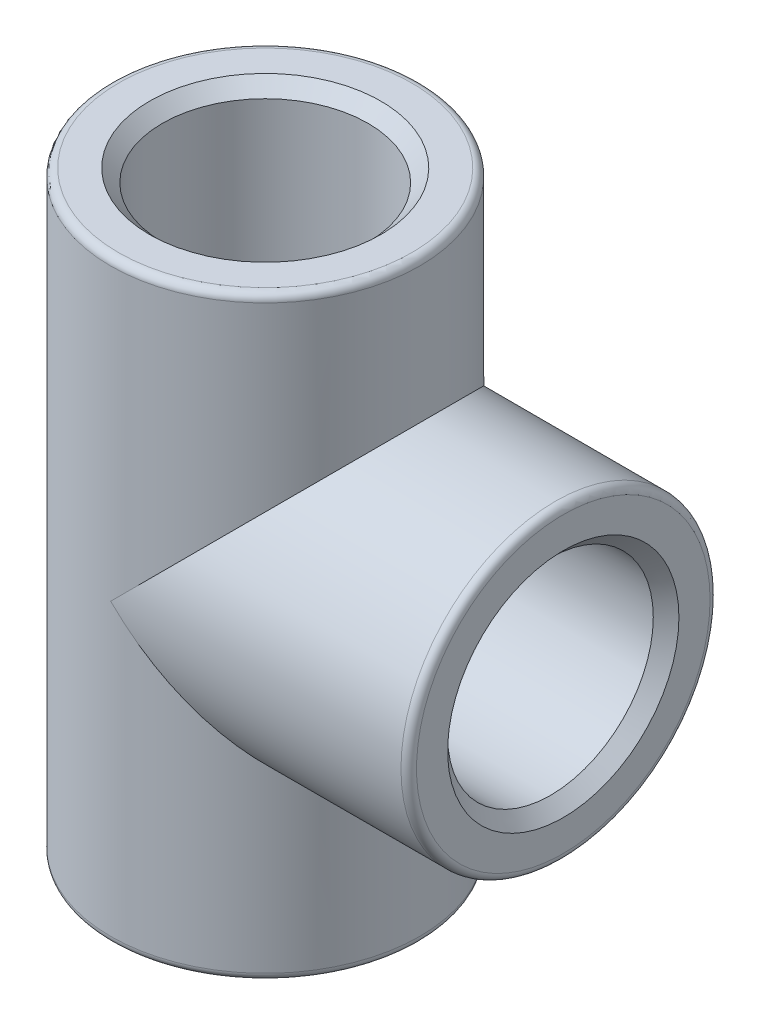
ISO-10303-21;
HEADER;
FILE_DESCRIPTION(('STEP AP214'),'2;1');
FILE_NAME('part.step','',(''),(''),'','','');
FILE_SCHEMA(('AUTOMOTIVE_DESIGN { 1 0 10303 214 1 1 1 1 }'));
ENDSEC;
DATA;
#1=APPLICATION_CONTEXT('core data for automotive mechanical design processes');
#2=APPLICATION_PROTOCOL_DEFINITION('international standard','automotive_design',2000,#1);
#3=PRODUCT_CONTEXT('',#1,'mechanical');
#4=PRODUCT('Part','Part','',(#3));
#5=PRODUCT_RELATED_PRODUCT_CATEGORY('part','',(#4));
#6=PRODUCT_DEFINITION_FORMATION('','',#4);
#7=PRODUCT_DEFINITION_CONTEXT('part definition',#1,'design');
#8=PRODUCT_DEFINITION('design','',#6,#7);
#9=PRODUCT_DEFINITION_SHAPE('','',#8);
#10=(LENGTH_UNIT() NAMED_UNIT(*) SI_UNIT(.MILLI.,.METRE.));
#11=(NAMED_UNIT(*) PLANE_ANGLE_UNIT() SI_UNIT($,.RADIAN.));
#12=(NAMED_UNIT(*) SI_UNIT($,.STERADIAN.) SOLID_ANGLE_UNIT());
#13=UNCERTAINTY_MEASURE_WITH_UNIT(LENGTH_MEASURE(1.E-05),#10,'distance_accuracy_value','');
#14=(GEOMETRIC_REPRESENTATION_CONTEXT(3) GLOBAL_UNCERTAINTY_ASSIGNED_CONTEXT((#13)) GLOBAL_UNIT_ASSIGNED_CONTEXT((#10,
#11,#12)) REPRESENTATION_CONTEXT('',''));
#15=CARTESIAN_POINT('',(0.,0.,0.));
#16=DIRECTION('',(0.,0.,1.));
#17=DIRECTION('',(1.,0.,0.));
#18=AXIS2_PLACEMENT_3D('',#15,#16,#17);
#19=CARTESIAN_POINT('',(0.,0.,0.));
#20=DIRECTION('',(0.,1.,0.));
#21=DIRECTION('',(0.,0.,1.));
#22=AXIS2_PLACEMENT_3D('',#19,#20,#21);
#23=CYLINDRICAL_SURFACE('',#22,14.);
#24=CARTESIAN_POINT('',(0.,0.7045,0.));
#25=DIRECTION('',(0.,-1.,0.));
#26=DIRECTION('',(0.,0.,-1.));
#27=AXIS2_PLACEMENT_3D('',#24,#25,#26);
#28=CIRCLE('',#27,14.);
#29=CARTESIAN_POINT('',(0.,0.7045,-14.));
#30=VERTEX_POINT('',#29);
#31=EDGE_CURVE('E92',#30,#30,#28,.F.);
#32=ORIENTED_EDGE('',*,*,#31,.T.);
#33=EDGE_LOOP('',(#32));
#34=FACE_BOUND('',#33,.T.);
#35=CARTESIAN_POINT('',(0.,53.2955,0.));
#36=DIRECTION('',(0.,1.,0.));
#37=DIRECTION('',(0.,0.,1.));
#38=AXIS2_PLACEMENT_3D('',#35,#36,#37);
#39=CIRCLE('',#38,14.);
#40=CARTESIAN_POINT('',(0.,53.2955,14.));
#41=VERTEX_POINT('',#40);
#42=EDGE_CURVE('E89',#41,#41,#39,.F.);
#43=ORIENTED_EDGE('',*,*,#42,.T.);
#44=EDGE_LOOP('',(#43));
#45=FACE_BOUND('',#44,.T.);
#46=CARTESIAN_POINT('',(0.,27.,0.));
#47=DIRECTION('',(0.707106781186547,0.707106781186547,0.));
#48=DIRECTION('',(-0.707106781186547,0.707106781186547,0.));
#49=AXIS2_PLACEMENT_3D('',#46,#47,#48);
#50=ELLIPSE('',#49,19.7989898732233,14.);
#51=CARTESIAN_POINT('',(0.,27.,14.));
#52=VERTEX_POINT('',#51);
#53=CARTESIAN_POINT('',(0.,27.,-14.));
#54=VERTEX_POINT('',#53);
#55=EDGE_CURVE('E64',#52,#54,#50,.T.);
#56=ORIENTED_EDGE('',*,*,#55,.F.);
#57=CARTESIAN_POINT('',(0.,27.,0.));
#58=DIRECTION('',(-0.707106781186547,0.707106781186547,0.));
#59=DIRECTION('',(0.707106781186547,0.707106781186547,0.));
#60=AXIS2_PLACEMENT_3D('',#57,#58,#59);
#61=ELLIPSE('',#60,19.7989898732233,14.);
#62=EDGE_CURVE('E55',#54,#52,#61,.F.);
#63=ORIENTED_EDGE('',*,*,#62,.F.);
#64=EDGE_LOOP('',(#56,#63));
#65=FACE_BOUND('',#64,.T.);
#66=ADVANCED_FACE('F34',(#34,#45,#65),#23,.T.);
#67=CARTESIAN_POINT('',(14.,0.,0.));
#68=DIRECTION('',(0.,-1.,0.));
#69=DIRECTION('',(0.,0.,-1.));
#70=AXIS2_PLACEMENT_3D('',#67,#68,#69);
#71=PLANE('',#70);
#72=CARTESIAN_POINT('',(0.,0.,0.));
#73=DIRECTION('',(0.,-1.,0.));
#74=DIRECTION('',(0.,0.,-1.));
#75=AXIS2_PLACEMENT_3D('',#72,#73,#74);
#76=CIRCLE('',#75,13.2955);
#77=CARTESIAN_POINT('',(0.,0.,-13.2955));
#78=VERTEX_POINT('',#77);
#79=EDGE_CURVE('E95',#78,#78,#76,.T.);
#80=ORIENTED_EDGE('',*,*,#79,.T.);
#81=EDGE_LOOP('',(#80));
#82=FACE_BOUND('',#81,.T.);
#83=CARTESIAN_POINT('',(0.,0.,0.));
#84=DIRECTION('',(0.,-1.,0.));
#85=DIRECTION('',(0.,0.,-1.));
#86=AXIS2_PLACEMENT_3D('',#83,#84,#85);
#87=CIRCLE('',#86,10.4775);
#88=CARTESIAN_POINT('',(0.,0.,-10.4775));
#89=VERTEX_POINT('',#88);
#90=EDGE_CURVE('E77',#89,#89,#87,.F.);
#91=ORIENTED_EDGE('',*,*,#90,.T.);
#92=EDGE_LOOP('',(#91));
#93=FACE_BOUND('',#92,.T.);
#94=ADVANCED_FACE('F116',(#82,#93),#71,.T.);
#95=CARTESIAN_POINT('',(0.,54.,0.));
#96=DIRECTION('',(0.,1.,0.));
#97=DIRECTION('',(0.,0.,1.));
#98=AXIS2_PLACEMENT_3D('',#95,#96,#97);
#99=PLANE('',#98);
#100=CARTESIAN_POINT('',(0.,54.,0.));
#101=DIRECTION('',(0.,1.,0.));
#102=DIRECTION('',(0.,0.,1.));
#103=AXIS2_PLACEMENT_3D('',#100,#101,#102);
#104=CIRCLE('',#103,13.2955);
#105=CARTESIAN_POINT('',(0.,54.,13.2955));
#106=VERTEX_POINT('',#105);
#107=EDGE_CURVE('E98',#106,#106,#104,.T.);
#108=ORIENTED_EDGE('',*,*,#107,.T.);
#109=EDGE_LOOP('',(#108));
#110=FACE_BOUND('',#109,.T.);
#111=CARTESIAN_POINT('',(0.,54.,0.));
#112=DIRECTION('',(0.,1.,0.));
#113=DIRECTION('',(0.,0.,1.));
#114=AXIS2_PLACEMENT_3D('',#111,#112,#113);
#115=CIRCLE('',#114,10.4775);
#116=CARTESIAN_POINT('',(0.,54.,10.4775));
#117=VERTEX_POINT('',#116);
#118=EDGE_CURVE('E71',#117,#117,#115,.F.);
#119=ORIENTED_EDGE('',*,*,#118,.T.);
#120=EDGE_LOOP('',(#119));
#121=FACE_BOUND('',#120,.T.);
#122=ADVANCED_FACE('F122',(#110,#121),#99,.T.);
#123=CARTESIAN_POINT('',(27.,27.,0.));
#124=DIRECTION('',(1.,0.,0.));
#125=DIRECTION('',(0.,0.,-1.));
#126=AXIS2_PLACEMENT_3D('',#123,#124,#125);
#127=PLANE('',#126);
#128=CARTESIAN_POINT('',(27.,27.,0.));
#129=DIRECTION('',(1.,0.,0.));
#130=DIRECTION('',(0.,0.,-1.));
#131=AXIS2_PLACEMENT_3D('',#128,#129,#130);
#132=CIRCLE('',#131,13.2955);
#133=CARTESIAN_POINT('',(27.,27.,-13.2955));
#134=VERTEX_POINT('',#133);
#135=EDGE_CURVE('E42',#134,#134,#132,.T.);
#136=ORIENTED_EDGE('',*,*,#135,.T.);
#137=EDGE_LOOP('',(#136));
#138=FACE_BOUND('',#137,.T.);
#139=CARTESIAN_POINT('',(27.,27.,0.));
#140=DIRECTION('',(1.,0.,0.));
#141=DIRECTION('',(0.,0.,-1.));
#142=AXIS2_PLACEMENT_3D('',#139,#140,#141);
#143=CIRCLE('',#142,10.4775);
#144=CARTESIAN_POINT('',(27.,27.,-10.4775));
#145=VERTEX_POINT('',#144);
#146=EDGE_CURVE('E86',#145,#145,#143,.F.);
#147=ORIENTED_EDGE('',*,*,#146,.T.);
#148=EDGE_LOOP('',(#147));
#149=FACE_BOUND('',#148,.T.);
#150=ADVANCED_FACE('F103',(#138,#149),#127,.T.);
#151=CARTESIAN_POINT('',(0.,27.,0.));
#152=DIRECTION('',(1.,0.,0.));
#153=DIRECTION('',(0.,0.,-1.));
#154=AXIS2_PLACEMENT_3D('',#151,#152,#153);
#155=CYLINDRICAL_SURFACE('',#154,14.);
#156=CARTESIAN_POINT('',(26.2955,27.,0.));
#157=DIRECTION('',(1.,0.,0.));
#158=DIRECTION('',(0.,0.,-1.));
#159=AXIS2_PLACEMENT_3D('',#156,#157,#158);
#160=CIRCLE('',#159,14.);
#161=CARTESIAN_POINT('',(26.2955,27.,-14.));
#162=VERTEX_POINT('',#161);
#163=EDGE_CURVE('E11',#162,#162,#160,.F.);
#164=ORIENTED_EDGE('',*,*,#163,.T.);
#165=EDGE_LOOP('',(#164));
#166=FACE_BOUND('',#165,.T.);
#167=ORIENTED_EDGE('',*,*,#62,.T.);
#168=ORIENTED_EDGE('',*,*,#55,.T.);
#169=EDGE_LOOP('',(#167,#168));
#170=FACE_BOUND('',#169,.T.);
#171=ADVANCED_FACE('F247',(#166,#170),#155,.T.);
#172=CARTESIAN_POINT('',(0.,0.,0.));
#173=DIRECTION('',(0.,1.,0.));
#174=DIRECTION('',(0.,0.,1.));
#175=AXIS2_PLACEMENT_3D('',#172,#173,#174);
#176=CYLINDRICAL_SURFACE('',#175,9.3155);
#177=CARTESIAN_POINT('',(0.,1.162,0.));
#178=DIRECTION('',(0.,-1.,0.));
#179=DIRECTION('',(0.,0.,-1.));
#180=AXIS2_PLACEMENT_3D('',#177,#178,#179);
#181=CIRCLE('',#180,9.3155);
#182=CARTESIAN_POINT('',(0.,1.162,-9.3155));
#183=VERTEX_POINT('',#182);
#184=EDGE_CURVE('E80',#183,#183,#181,.T.);
#185=ORIENTED_EDGE('',*,*,#184,.T.);
#186=EDGE_LOOP('',(#185));
#187=FACE_BOUND('',#186,.T.);
#188=CARTESIAN_POINT('',(0.,16.,0.));
#189=DIRECTION('',(0.,1.,0.));
#190=DIRECTION('',(0.,0.,1.));
#191=AXIS2_PLACEMENT_3D('',#188,#189,#190);
#192=CIRCLE('',#191,9.3155);
#193=CARTESIAN_POINT('',(0.,16.,9.3155));
#194=VERTEX_POINT('',#193);
#195=EDGE_CURVE('E314',#194,#194,#192,.T.);
#196=ORIENTED_EDGE('',*,*,#195,.T.);
#197=EDGE_LOOP('',(#196));
#198=FACE_BOUND('',#197,.T.);
#199=ADVANCED_FACE('F239',(#187,#198),#176,.F.);
#200=CARTESIAN_POINT('',(0.,0.,0.));
#201=DIRECTION('',(0.,1.,0.));
#202=DIRECTION('',(0.,0.,1.));
#203=AXIS2_PLACEMENT_3D('',#200,#201,#202);
#204=CYLINDRICAL_SURFACE('',#203,9.3155);
#205=CARTESIAN_POINT('',(0.,52.838,0.));
#206=DIRECTION('',(0.,1.,0.));
#207=DIRECTION('',(0.,0.,1.));
#208=AXIS2_PLACEMENT_3D('',#205,#206,#207);
#209=CIRCLE('',#208,9.3155);
#210=CARTESIAN_POINT('',(0.,52.838,9.3155));
#211=VERTEX_POINT('',#210);
#212=EDGE_CURVE('E68',#211,#211,#209,.T.);
#213=ORIENTED_EDGE('',*,*,#212,.T.);
#214=EDGE_LOOP('',(#213));
#215=FACE_BOUND('',#214,.T.);
#216=CARTESIAN_POINT('',(0.,38.,0.));
#217=DIRECTION('',(0.,1.,0.));
#218=DIRECTION('',(0.,0.,1.));
#219=AXIS2_PLACEMENT_3D('',#216,#217,#218);
#220=CIRCLE('',#219,9.3155);
#221=CARTESIAN_POINT('',(0.,38.,9.3155));
#222=VERTEX_POINT('',#221);
#223=EDGE_CURVE('E302',#222,#222,#220,.T.);
#224=ORIENTED_EDGE('',*,*,#223,.F.);
#225=EDGE_LOOP('',(#224));
#226=FACE_BOUND('',#225,.T.);
#227=ADVANCED_FACE('F231',(#215,#226),#204,.F.);
#228=CARTESIAN_POINT('',(9.3155,38.,0.));
#229=DIRECTION('',(0.,-1.,0.));
#230=DIRECTION('',(0.,0.,-1.));
#231=AXIS2_PLACEMENT_3D('',#228,#229,#230);
#232=PLANE('',#231);
#233=CARTESIAN_POINT('',(0.,38.,0.));
#234=DIRECTION('',(0.,1.,0.));
#235=DIRECTION('',(0.,0.,1.));
#236=AXIS2_PLACEMENT_3D('',#233,#234,#235);
#237=CIRCLE('',#236,8.38395);
#238=CARTESIAN_POINT('',(0.,38.,8.38395));
#239=VERTEX_POINT('',#238);
#240=EDGE_CURVE('E304',#239,#239,#237,.T.);
#241=ORIENTED_EDGE('',*,*,#240,.F.);
#242=EDGE_LOOP('',(#241));
#243=FACE_BOUND('',#242,.T.);
#244=ORIENTED_EDGE('',*,*,#223,.T.);
#245=EDGE_LOOP('',(#244));
#246=FACE_BOUND('',#245,.T.);
#247=ADVANCED_FACE('F224',(#243,#246),#232,.F.);
#248=CARTESIAN_POINT('',(0.,0.,0.));
#249=DIRECTION('',(0.,1.,0.));
#250=DIRECTION('',(0.,0.,1.));
#251=AXIS2_PLACEMENT_3D('',#248,#249,#250);
#252=CYLINDRICAL_SURFACE('',#251,8.38395);
#253=CARTESIAN_POINT('',(0.,27.,0.));
#254=DIRECTION('',(-0.707106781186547,0.707106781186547,0.));
#255=DIRECTION('',(0.707106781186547,0.707106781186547,0.));
#256=AXIS2_PLACEMENT_3D('',#253,#254,#255);
#257=ELLIPSE('',#256,11.8566957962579,8.38395);
#258=CARTESIAN_POINT('',(0.,27.,-8.38394999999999));
#259=VERTEX_POINT('',#258);
#260=CARTESIAN_POINT('',(0.,27.,8.38395));
#261=VERTEX_POINT('',#260);
#262=EDGE_CURVE('E60',#259,#261,#257,.F.);
#263=ORIENTED_EDGE('',*,*,#262,.T.);
#264=CARTESIAN_POINT('',(0.,27.,0.));
#265=DIRECTION('',(0.707106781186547,0.707106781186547,0.));
#266=DIRECTION('',(-0.707106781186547,0.707106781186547,0.));
#267=AXIS2_PLACEMENT_3D('',#264,#265,#266);
#268=ELLIPSE('',#267,11.8566957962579,8.38395);
#269=EDGE_CURVE('E48',#261,#259,#268,.T.);
#270=ORIENTED_EDGE('',*,*,#269,.T.);
#271=EDGE_LOOP('',(#263,#270));
#272=FACE_BOUND('',#271,.T.);
#273=CARTESIAN_POINT('',(0.,16.,0.));
#274=DIRECTION('',(0.,1.,0.));
#275=DIRECTION('',(0.,0.,1.));
#276=AXIS2_PLACEMENT_3D('',#273,#274,#275);
#277=CIRCLE('',#276,8.38395);
#278=CARTESIAN_POINT('',(0.,16.,8.38395));
#279=VERTEX_POINT('',#278);
#280=EDGE_CURVE('E308',#279,#279,#277,.T.);
#281=ORIENTED_EDGE('',*,*,#280,.F.);
#282=EDGE_LOOP('',(#281));
#283=FACE_BOUND('',#282,.T.);
#284=ORIENTED_EDGE('',*,*,#240,.T.);
#285=EDGE_LOOP('',(#284));
#286=FACE_BOUND('',#285,.T.);
#287=ADVANCED_FACE('F66',(#272,#283,#286),#252,.F.);
#288=CARTESIAN_POINT('',(8.38395,16.,0.));
#289=DIRECTION('',(0.,1.,0.));
#290=DIRECTION('',(0.,0.,1.));
#291=AXIS2_PLACEMENT_3D('',#288,#289,#290);
#292=PLANE('',#291);
#293=ORIENTED_EDGE('',*,*,#195,.F.);
#294=EDGE_LOOP('',(#293));
#295=FACE_BOUND('',#294,.T.);
#296=ORIENTED_EDGE('',*,*,#280,.T.);
#297=EDGE_LOOP('',(#296));
#298=FACE_BOUND('',#297,.T.);
#299=ADVANCED_FACE('F207',(#295,#298),#292,.F.);
#300=CARTESIAN_POINT('',(27.,27.,0.));
#301=DIRECTION('',(1.,0.,0.));
#302=DIRECTION('',(0.,0.,-1.));
#303=AXIS2_PLACEMENT_3D('',#300,#301,#302);
#304=CYLINDRICAL_SURFACE('',#303,8.38395);
#305=ORIENTED_EDGE('',*,*,#262,.F.);
#306=ORIENTED_EDGE('',*,*,#269,.F.);
#307=EDGE_LOOP('',(#305,#306));
#308=FACE_BOUND('',#307,.T.);
#309=CARTESIAN_POINT('',(11.,27.,0.));
#310=DIRECTION('',(1.,0.,0.));
#311=DIRECTION('',(0.,0.,-1.));
#312=AXIS2_PLACEMENT_3D('',#309,#310,#311);
#313=CIRCLE('',#312,8.38395);
#314=CARTESIAN_POINT('',(11.,27.,-8.38395));
#315=VERTEX_POINT('',#314);
#316=EDGE_CURVE('E317',#315,#315,#313,.T.);
#317=ORIENTED_EDGE('',*,*,#316,.T.);
#318=EDGE_LOOP('',(#317));
#319=FACE_BOUND('',#318,.T.);
#320=ADVANCED_FACE('F61',(#308,#319),#304,.F.);
#321=CARTESIAN_POINT('',(11.,35.38395,0.));
#322=DIRECTION('',(-1.,0.,0.));
#323=DIRECTION('',(0.,0.,1.));
#324=AXIS2_PLACEMENT_3D('',#321,#322,#323);
#325=PLANE('',#324);
#326=ORIENTED_EDGE('',*,*,#316,.F.);
#327=EDGE_LOOP('',(#326));
#328=FACE_BOUND('',#327,.T.);
#329=CARTESIAN_POINT('',(11.,27.,0.));
#330=DIRECTION('',(1.,0.,0.));
#331=DIRECTION('',(0.,0.,-1.));
#332=AXIS2_PLACEMENT_3D('',#329,#330,#331);
#333=CIRCLE('',#332,9.31549999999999);
#334=CARTESIAN_POINT('',(11.,27.,-9.31549999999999));
#335=VERTEX_POINT('',#334);
#336=EDGE_CURVE('E320',#335,#335,#333,.T.);
#337=ORIENTED_EDGE('',*,*,#336,.T.);
#338=EDGE_LOOP('',(#337));
#339=FACE_BOUND('',#338,.T.);
#340=ADVANCED_FACE('F188',(#328,#339),#325,.F.);
#341=CARTESIAN_POINT('',(27.,27.,0.));
#342=DIRECTION('',(1.,0.,0.));
#343=DIRECTION('',(0.,0.,-1.));
#344=AXIS2_PLACEMENT_3D('',#341,#342,#343);
#345=CYLINDRICAL_SURFACE('',#344,9.31549999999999);
#346=CARTESIAN_POINT('',(25.838,27.,0.));
#347=DIRECTION('',(1.,0.,0.));
#348=DIRECTION('',(0.,0.,-1.));
#349=AXIS2_PLACEMENT_3D('',#346,#347,#348);
#350=CIRCLE('',#349,9.31549999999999);
#351=CARTESIAN_POINT('',(25.838,27.,-9.31549999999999));
#352=VERTEX_POINT('',#351);
#353=EDGE_CURVE('E83',#352,#352,#350,.T.);
#354=ORIENTED_EDGE('',*,*,#353,.T.);
#355=EDGE_LOOP('',(#354));
#356=FACE_BOUND('',#355,.T.);
#357=ORIENTED_EDGE('',*,*,#336,.F.);
#358=EDGE_LOOP('',(#357));
#359=FACE_BOUND('',#358,.T.);
#360=ADVANCED_FACE('F132',(#356,#359),#345,.F.);
#361=CARTESIAN_POINT('',(0.,52.838,0.));
#362=DIRECTION('',(0.,1.,0.));
#363=DIRECTION('',(0.,0.,1.));
#364=AXIS2_PLACEMENT_3D('',#361,#362,#363);
#365=CONICAL_SURFACE('',#364,9.3155,0.785398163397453);
#366=ORIENTED_EDGE('',*,*,#118,.F.);
#367=EDGE_LOOP('',(#366));
#368=FACE_BOUND('',#367,.T.);
#369=ORIENTED_EDGE('',*,*,#212,.F.);
#370=EDGE_LOOP('',(#369));
#371=FACE_BOUND('',#370,.T.);
#372=ADVANCED_FACE('F128',(#368,#371),#365,.F.);
#373=CARTESIAN_POINT('',(0.,0.,0.));
#374=DIRECTION('',(0.,-1.,0.));
#375=DIRECTION('',(0.,0.,-1.));
#376=AXIS2_PLACEMENT_3D('',#373,#374,#375);
#377=CONICAL_SURFACE('',#376,10.4775,0.785398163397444);
#378=ORIENTED_EDGE('',*,*,#184,.F.);
#379=EDGE_LOOP('',(#378));
#380=FACE_BOUND('',#379,.T.);
#381=ORIENTED_EDGE('',*,*,#90,.F.);
#382=EDGE_LOOP('',(#381));
#383=FACE_BOUND('',#382,.T.);
#384=ADVANCED_FACE('F131',(#380,#383),#377,.F.);
#385=CARTESIAN_POINT('',(25.838,27.,0.));
#386=DIRECTION('',(1.,0.,0.));
#387=DIRECTION('',(0.,0.,-1.));
#388=AXIS2_PLACEMENT_3D('',#385,#386,#387);
#389=CONICAL_SURFACE('',#388,9.31549999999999,0.785398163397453);
#390=CARTESIAN_POINT('',(27.,27.,-10.4775));
#391=CARTESIAN_POINT('',(26.9878958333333,27.,-10.4653958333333));
#392=CARTESIAN_POINT('',(26.9757916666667,27.,-10.4532916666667));
#393=CARTESIAN_POINT('',(26.9515833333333,27.,-10.4290833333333));
#394=CARTESIAN_POINT('',(26.9394791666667,27.,-10.4169791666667));
#395=CARTESIAN_POINT('',(26.9152708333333,27.,-10.3927708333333));
#396=CARTESIAN_POINT('',(26.9031666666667,27.,-10.3806666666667));
#397=CARTESIAN_POINT('',(26.8789583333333,27.,-10.3564583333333));
#398=CARTESIAN_POINT('',(26.8668541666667,27.,-10.3443541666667));
#399=CARTESIAN_POINT('',(26.8426458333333,27.,-10.3201458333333));
#400=CARTESIAN_POINT('',(26.8305416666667,27.,-10.3080416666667));
#401=CARTESIAN_POINT('',(26.8063333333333,27.,-10.2838333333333));
#402=CARTESIAN_POINT('',(26.7942291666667,27.,-10.2717291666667));
#403=CARTESIAN_POINT('',(26.7700208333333,27.,-10.2475208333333));
#404=CARTESIAN_POINT('',(26.7579166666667,27.,-10.2354166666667));
#405=CARTESIAN_POINT('',(26.7337083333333,27.,-10.2112083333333));
#406=CARTESIAN_POINT('',(26.7216041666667,27.,-10.1991041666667));
#407=CARTESIAN_POINT('',(26.6973958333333,27.,-10.1748958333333));
#408=CARTESIAN_POINT('',(26.6852916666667,27.,-10.1627916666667));
#409=CARTESIAN_POINT('',(26.6610833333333,27.,-10.1385833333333));
#410=CARTESIAN_POINT('',(26.6489791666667,27.,-10.1264791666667));
#411=CARTESIAN_POINT('',(26.6247708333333,27.,-10.1022708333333));
#412=CARTESIAN_POINT('',(26.6126666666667,27.,-10.0901666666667));
#413=CARTESIAN_POINT('',(26.5884583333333,27.,-10.0659583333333));
#414=CARTESIAN_POINT('',(26.5763541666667,27.,-10.0538541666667));
#415=CARTESIAN_POINT('',(26.5521458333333,27.,-10.0296458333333));
#416=CARTESIAN_POINT('',(26.5400416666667,27.,-10.0175416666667));
#417=CARTESIAN_POINT('',(26.5158333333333,27.,-9.99333333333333));
#418=CARTESIAN_POINT('',(26.5037291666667,27.,-9.98122916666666));
#419=CARTESIAN_POINT('',(26.4795208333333,27.,-9.95702083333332));
#420=CARTESIAN_POINT('',(26.4674166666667,27.,-9.94491666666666));
#421=CARTESIAN_POINT('',(26.4432083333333,27.,-9.92070833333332));
#422=CARTESIAN_POINT('',(26.4311041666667,27.,-9.90860416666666));
#423=CARTESIAN_POINT('',(26.4068958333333,27.,-9.88439583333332));
#424=CARTESIAN_POINT('',(26.3947916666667,27.,-9.87229166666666));
#425=CARTESIAN_POINT('',(26.3705833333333,27.,-9.84808333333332));
#426=CARTESIAN_POINT('',(26.3584791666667,27.,-9.83597916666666));
#427=CARTESIAN_POINT('',(26.3342708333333,27.,-9.81177083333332));
#428=CARTESIAN_POINT('',(26.3221666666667,27.,-9.79966666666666));
#429=CARTESIAN_POINT('',(26.2979583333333,27.,-9.77545833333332));
#430=CARTESIAN_POINT('',(26.2858541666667,27.,-9.76335416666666));
#431=CARTESIAN_POINT('',(26.2616458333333,27.,-9.73914583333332));
#432=CARTESIAN_POINT('',(26.2495416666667,27.,-9.72704166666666));
#433=CARTESIAN_POINT('',(26.2253333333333,27.,-9.70283333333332));
#434=CARTESIAN_POINT('',(26.2132291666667,27.,-9.69072916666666));
#435=CARTESIAN_POINT('',(26.1890208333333,27.,-9.66652083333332));
#436=CARTESIAN_POINT('',(26.1769166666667,27.,-9.65441666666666));
#437=CARTESIAN_POINT('',(26.1527083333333,27.,-9.63020833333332));
#438=CARTESIAN_POINT('',(26.1406041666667,27.,-9.61810416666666));
#439=CARTESIAN_POINT('',(26.1163958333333,27.,-9.59389583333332));
#440=CARTESIAN_POINT('',(26.1042916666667,27.,-9.58179166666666));
#441=CARTESIAN_POINT('',(26.0800833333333,27.,-9.55758333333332));
#442=CARTESIAN_POINT('',(26.0679791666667,27.,-9.54547916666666));
#443=CARTESIAN_POINT('',(26.0437708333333,27.,-9.52127083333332));
#444=CARTESIAN_POINT('',(26.0316666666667,27.,-9.50916666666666));
#445=CARTESIAN_POINT('',(26.0074583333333,27.,-9.48495833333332));
#446=CARTESIAN_POINT('',(25.9953541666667,27.,-9.47285416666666));
#447=CARTESIAN_POINT('',(25.9711458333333,27.,-9.44864583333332));
#448=CARTESIAN_POINT('',(25.9590416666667,27.,-9.43654166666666));
#449=CARTESIAN_POINT('',(25.9348333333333,27.,-9.41233333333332));
#450=CARTESIAN_POINT('',(25.9227291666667,27.,-9.40022916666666));
#451=CARTESIAN_POINT('',(25.8985208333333,27.,-9.37602083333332));
#452=CARTESIAN_POINT('',(25.8864166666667,27.,-9.36391666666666));
#453=CARTESIAN_POINT('',(25.8622083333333,27.,-9.33970833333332));
#454=CARTESIAN_POINT('',(25.8501041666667,27.,-9.32760416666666));
#455=CARTESIAN_POINT('',(25.838,27.,-9.31549999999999));
#456=B_SPLINE_CURVE_WITH_KNOTS('',3,(#390,#391,#392,#393,#394,#395,#396,#397,#398,#399,#400,
#401,#402,#403,#404,#405,#406,#407,#408,#409,#410,#411,#412,#413,#414,#415,#416,#417,#418,#419,
#420,#421,#422,#423,#424,#425,#426,#427,#428,#429,#430,#431,#432,#433,#434,#435,#436,#437,#438,
#439,#440,#441,#442,#443,#444,#445,#446,#447,#448,#449,#450,#451,#452,#453,#454,#455),
.UNSPECIFIED.,.F.,.F.,(4,2,2,2,2,2,2,2,2,2,2,2,2,2,2,2,2,2,2,2,2,2,2,2,2,2,2,2,2,2,2,2,4),(0.,
0.0513536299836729,0.102707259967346,0.154060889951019,0.205414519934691,0.256768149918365,
0.308121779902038,0.359475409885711,0.410829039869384,0.462182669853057,0.51353629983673,
0.564889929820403,0.616243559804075,0.667597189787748,0.718950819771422,0.770304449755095,
0.821658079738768,0.873011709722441,0.924365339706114,0.975718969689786,1.02707259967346,
1.07842622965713,1.12977985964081,1.18113348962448,1.23248711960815,1.28384074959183,
1.3351943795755,1.38654800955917,1.43790163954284,1.48925526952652,1.54060889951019,
1.59196252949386,1.64331615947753),.UNSPECIFIED.);
#457=EDGE_CURVE('BSEAM136',#145,#352,#456,.T.);
#458=ORIENTED_EDGE('',*,*,#146,.F.);
#459=ORIENTED_EDGE('',*,*,#353,.F.);
#460=ORIENTED_EDGE('',*,*,#457,.T.);
#461=ORIENTED_EDGE('',*,*,#457,.F.);
#462=EDGE_LOOP('',(#458,#460,#459,#461));
#463=FACE_BOUND('',#462,.T.);
#464=ADVANCED_FACE('F136',(#463),#389,.F.);
#465=CARTESIAN_POINT('',(0.,0.7045,0.));
#466=DIRECTION('',(0.,-1.,0.));
#467=DIRECTION('',(0.,0.,-1.));
#468=AXIS2_PLACEMENT_3D('',#465,#466,#467);
#469=TOROIDAL_SURFACE('',#468,13.2955,0.7045);
#470=ORIENTED_EDGE('',*,*,#79,.F.);
#471=EDGE_LOOP('',(#470));
#472=FACE_BOUND('',#471,.T.);
#473=ORIENTED_EDGE('',*,*,#31,.F.);
#474=EDGE_LOOP('',(#473));
#475=FACE_BOUND('',#474,.T.);
#476=ADVANCED_FACE('F112',(#472,#475),#469,.T.);
#477=CARTESIAN_POINT('',(0.,53.2955,0.));
#478=DIRECTION('',(0.,1.,0.));
#479=DIRECTION('',(0.,0.,1.));
#480=AXIS2_PLACEMENT_3D('',#477,#478,#479);
#481=TOROIDAL_SURFACE('',#480,13.2955,0.7045);
#482=ORIENTED_EDGE('',*,*,#42,.F.);
#483=EDGE_LOOP('',(#482));
#484=FACE_BOUND('',#483,.T.);
#485=ORIENTED_EDGE('',*,*,#107,.F.);
#486=EDGE_LOOP('',(#485));
#487=FACE_BOUND('',#486,.T.);
#488=ADVANCED_FACE('F107',(#484,#487),#481,.T.);
#489=CARTESIAN_POINT('',(26.2955,27.,0.));
#490=DIRECTION('',(1.,0.,0.));
#491=DIRECTION('',(0.,0.,-1.));
#492=AXIS2_PLACEMENT_3D('',#489,#490,#491);
#493=TOROIDAL_SURFACE('',#492,13.2955,0.7045);
#494=ORIENTED_EDGE('',*,*,#163,.F.);
#495=EDGE_LOOP('',(#494));
#496=FACE_BOUND('',#495,.T.);
#497=ORIENTED_EDGE('',*,*,#135,.F.);
#498=EDGE_LOOP('',(#497));
#499=FACE_BOUND('',#498,.T.);
#500=ADVANCED_FACE('F36',(#496,#499),#493,.T.);
#501=CLOSED_SHELL('',(#66,#94,#122,#150,#171,#199,#227,#247,#287,#299,#320,#340,#360,#372,#384,
#464,#476,#488,#500));
#502=MANIFOLD_SOLID_BREP('B2',#501);
#503=ADVANCED_BREP_SHAPE_REPRESENTATION('',(#18,#502),#14);
#504=SHAPE_DEFINITION_REPRESENTATION(#9,#503);
ENDSEC;
END-ISO-10303-21;
